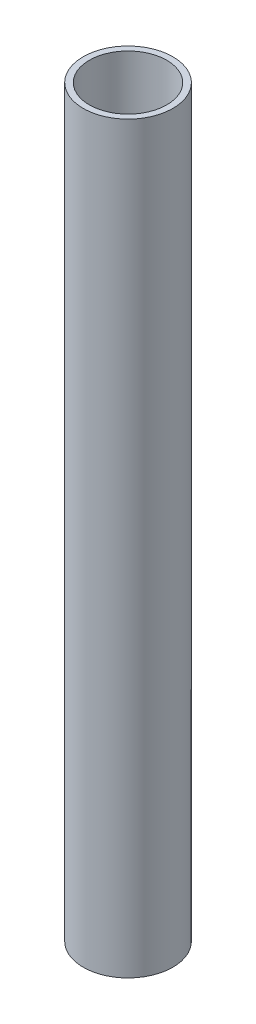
ISO-10303-21;
HEADER;
FILE_DESCRIPTION(('STEP AP214'),'2;1');
FILE_NAME('part.step','',(''),(''),'','','');
FILE_SCHEMA(('AUTOMOTIVE_DESIGN { 1 0 10303 214 1 1 1 1 }'));
ENDSEC;
DATA;
#1=APPLICATION_CONTEXT('core data for automotive mechanical design processes');
#2=APPLICATION_PROTOCOL_DEFINITION('international standard','automotive_design',2000,#1);
#3=PRODUCT_CONTEXT('',#1,'mechanical');
#4=PRODUCT('Part','Part','',(#3));
#5=PRODUCT_RELATED_PRODUCT_CATEGORY('part','',(#4));
#6=PRODUCT_DEFINITION_FORMATION('','',#4);
#7=PRODUCT_DEFINITION_CONTEXT('part definition',#1,'design');
#8=PRODUCT_DEFINITION('design','',#6,#7);
#9=PRODUCT_DEFINITION_SHAPE('','',#8);
#10=(LENGTH_UNIT() NAMED_UNIT(*) SI_UNIT(.MILLI.,.METRE.));
#11=(NAMED_UNIT(*) PLANE_ANGLE_UNIT() SI_UNIT($,.RADIAN.));
#12=(NAMED_UNIT(*) SI_UNIT($,.STERADIAN.) SOLID_ANGLE_UNIT());
#13=UNCERTAINTY_MEASURE_WITH_UNIT(LENGTH_MEASURE(1.E-05),#10,'distance_accuracy_value','');
#14=(GEOMETRIC_REPRESENTATION_CONTEXT(3) GLOBAL_UNCERTAINTY_ASSIGNED_CONTEXT((#13)) GLOBAL_UNIT_ASSIGNED_CONTEXT((#10,
#11,#12)) REPRESENTATION_CONTEXT('',''));
#15=CARTESIAN_POINT('',(0.,0.,0.));
#16=DIRECTION('',(0.,0.,1.));
#17=DIRECTION('',(1.,0.,0.));
#18=AXIS2_PLACEMENT_3D('',#15,#16,#17);
#19=CARTESIAN_POINT('',(0.,122.,0.));
#20=DIRECTION('',(0.,1.,0.));
#21=DIRECTION('',(0.,0.,1.));
#22=AXIS2_PLACEMENT_3D('',#19,#20,#21);
#23=PLANE('',#22);
#24=CARTESIAN_POINT('',(0.,122.,0.));
#25=DIRECTION('',(0.,1.,0.));
#26=DIRECTION('',(0.,0.,1.));
#27=AXIS2_PLACEMENT_3D('',#24,#25,#26);
#28=CIRCLE('',#27,7.35);
#29=CARTESIAN_POINT('',(0.,122.,-7.35));
#30=VERTEX_POINT('',#29);
#31=EDGE_CURVE('E10',#30,#30,#28,.T.);
#32=ORIENTED_EDGE('',*,*,#31,.T.);
#33=EDGE_LOOP('',(#32));
#34=FACE_BOUND('',#33,.T.);
#35=CARTESIAN_POINT('',(0.,122.,0.));
#36=DIRECTION('',(0.,1.,0.));
#37=DIRECTION('',(0.,0.,1.));
#38=AXIS2_PLACEMENT_3D('',#35,#36,#37);
#39=CIRCLE('',#38,6.35);
#40=CARTESIAN_POINT('',(0.,122.,-6.35));
#41=VERTEX_POINT('',#40);
#42=EDGE_CURVE('E56',#41,#41,#39,.T.);
#43=ORIENTED_EDGE('',*,*,#42,.F.);
#44=EDGE_LOOP('',(#43));
#45=FACE_BOUND('',#44,.T.);
#46=ADVANCED_FACE('F43',(#34,#45),#23,.T.);
#47=CARTESIAN_POINT('',(0.,0.,0.));
#48=DIRECTION('',(0.,1.,0.));
#49=DIRECTION('',(0.,0.,1.));
#50=AXIS2_PLACEMENT_3D('',#47,#48,#49);
#51=PLANE('',#50);
#52=CARTESIAN_POINT('',(0.,0.,0.));
#53=DIRECTION('',(0.,1.,0.));
#54=DIRECTION('',(0.,0.,1.));
#55=AXIS2_PLACEMENT_3D('',#52,#53,#54);
#56=CIRCLE('',#55,7.35);
#57=CARTESIAN_POINT('',(0.,0.,-7.35));
#58=VERTEX_POINT('',#57);
#59=EDGE_CURVE('E47',#58,#58,#56,.T.);
#60=ORIENTED_EDGE('',*,*,#59,.F.);
#61=EDGE_LOOP('',(#60));
#62=FACE_BOUND('',#61,.T.);
#63=CARTESIAN_POINT('',(0.,0.,0.));
#64=DIRECTION('',(0.,1.,0.));
#65=DIRECTION('',(0.,0.,1.));
#66=AXIS2_PLACEMENT_3D('',#63,#64,#65);
#67=CIRCLE('',#66,6.35);
#68=CARTESIAN_POINT('',(0.,0.,-6.35));
#69=VERTEX_POINT('',#68);
#70=EDGE_CURVE('E58',#69,#69,#67,.T.);
#71=ORIENTED_EDGE('',*,*,#70,.T.);
#72=EDGE_LOOP('',(#71));
#73=FACE_BOUND('',#72,.T.);
#74=ADVANCED_FACE('F70',(#62,#73),#51,.F.);
#75=CARTESIAN_POINT('',(0.,122.,0.));
#76=DIRECTION('',(0.,-1.,0.));
#77=DIRECTION('',(0.,0.,-1.));
#78=AXIS2_PLACEMENT_3D('',#75,#76,#77);
#79=CYLINDRICAL_SURFACE('',#78,7.35);
#80=CARTESIAN_POINT('',(0.,122.,-7.35));
#81=CARTESIAN_POINT('',(0.,120.729166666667,-7.35));
#82=CARTESIAN_POINT('',(0.,119.458333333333,-7.35));
#83=CARTESIAN_POINT('',(0.,116.916666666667,-7.35));
#84=CARTESIAN_POINT('',(0.,115.645833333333,-7.35));
#85=CARTESIAN_POINT('',(0.,113.104166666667,-7.35));
#86=CARTESIAN_POINT('',(0.,111.833333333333,-7.35));
#87=CARTESIAN_POINT('',(0.,109.291666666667,-7.35));
#88=CARTESIAN_POINT('',(0.,108.020833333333,-7.35));
#89=CARTESIAN_POINT('',(0.,105.479166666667,-7.35));
#90=CARTESIAN_POINT('',(0.,104.208333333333,-7.35));
#91=CARTESIAN_POINT('',(0.,101.666666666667,-7.35));
#92=CARTESIAN_POINT('',(0.,100.395833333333,-7.35));
#93=CARTESIAN_POINT('',(0.,97.8541666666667,-7.35));
#94=CARTESIAN_POINT('',(0.,96.5833333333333,-7.35));
#95=CARTESIAN_POINT('',(0.,94.0416666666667,-7.35));
#96=CARTESIAN_POINT('',(0.,92.7708333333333,-7.35));
#97=CARTESIAN_POINT('',(0.,90.2291666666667,-7.35));
#98=CARTESIAN_POINT('',(0.,88.9583333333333,-7.35));
#99=CARTESIAN_POINT('',(0.,86.4166666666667,-7.35));
#100=CARTESIAN_POINT('',(0.,85.1458333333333,-7.35));
#101=CARTESIAN_POINT('',(0.,82.6041666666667,-7.35));
#102=CARTESIAN_POINT('',(0.,81.3333333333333,-7.35));
#103=CARTESIAN_POINT('',(0.,78.7916666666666,-7.35));
#104=CARTESIAN_POINT('',(0.,77.5208333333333,-7.35));
#105=CARTESIAN_POINT('',(0.,74.9791666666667,-7.35));
#106=CARTESIAN_POINT('',(0.,73.7083333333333,-7.35));
#107=CARTESIAN_POINT('',(0.,71.1666666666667,-7.35));
#108=CARTESIAN_POINT('',(0.,69.8958333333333,-7.35));
#109=CARTESIAN_POINT('',(0.,67.3541666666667,-7.35));
#110=CARTESIAN_POINT('',(0.,66.0833333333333,-7.35));
#111=CARTESIAN_POINT('',(0.,63.5416666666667,-7.35));
#112=CARTESIAN_POINT('',(0.,62.2708333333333,-7.35));
#113=CARTESIAN_POINT('',(0.,59.7291666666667,-7.35));
#114=CARTESIAN_POINT('',(0.,58.4583333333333,-7.35));
#115=CARTESIAN_POINT('',(0.,55.9166666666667,-7.35));
#116=CARTESIAN_POINT('',(0.,54.6458333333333,-7.35));
#117=CARTESIAN_POINT('',(0.,52.1041666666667,-7.35));
#118=CARTESIAN_POINT('',(0.,50.8333333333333,-7.35));
#119=CARTESIAN_POINT('',(0.,48.2916666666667,-7.35));
#120=CARTESIAN_POINT('',(0.,47.0208333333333,-7.35));
#121=CARTESIAN_POINT('',(0.,44.4791666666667,-7.35));
#122=CARTESIAN_POINT('',(0.,43.2083333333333,-7.35));
#123=CARTESIAN_POINT('',(0.,40.6666666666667,-7.35));
#124=CARTESIAN_POINT('',(0.,39.3958333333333,-7.35));
#125=CARTESIAN_POINT('',(0.,36.8541666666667,-7.35));
#126=CARTESIAN_POINT('',(0.,35.5833333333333,-7.35));
#127=CARTESIAN_POINT('',(0.,33.0416666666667,-7.35));
#128=CARTESIAN_POINT('',(0.,31.7708333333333,-7.35));
#129=CARTESIAN_POINT('',(0.,29.2291666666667,-7.35));
#130=CARTESIAN_POINT('',(0.,27.9583333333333,-7.35));
#131=CARTESIAN_POINT('',(0.,25.4166666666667,-7.35));
#132=CARTESIAN_POINT('',(0.,24.1458333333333,-7.35));
#133=CARTESIAN_POINT('',(0.,21.6041666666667,-7.35));
#134=CARTESIAN_POINT('',(0.,20.3333333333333,-7.35));
#135=CARTESIAN_POINT('',(0.,17.7916666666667,-7.35));
#136=CARTESIAN_POINT('',(0.,16.5208333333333,-7.35));
#137=CARTESIAN_POINT('',(0.,13.9791666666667,-7.35));
#138=CARTESIAN_POINT('',(0.,12.7083333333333,-7.35));
#139=CARTESIAN_POINT('',(0.,10.1666666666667,-7.35));
#140=CARTESIAN_POINT('',(0.,8.89583333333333,-7.35));
#141=CARTESIAN_POINT('',(0.,6.35416666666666,-7.35));
#142=CARTESIAN_POINT('',(0.,5.08333333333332,-7.35));
#143=CARTESIAN_POINT('',(0.,2.54166666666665,-7.35));
#144=CARTESIAN_POINT('',(0.,1.27083333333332,-7.35));
#145=CARTESIAN_POINT('',(0.,0.,-7.35));
#146=B_SPLINE_CURVE_WITH_KNOTS('',3,(#80,#81,#82,#83,#84,#85,#86,#87,#88,#89,#90,#91,#92,#93,
#94,#95,#96,#97,#98,#99,#100,#101,#102,#103,#104,#105,#106,#107,#108,#109,#110,#111,#112,#113,
#114,#115,#116,#117,#118,#119,#120,#121,#122,#123,#124,#125,#126,#127,#128,#129,#130,#131,#132,
#133,#134,#135,#136,#137,#138,#139,#140,#141,#142,#143,#144,#145),.UNSPECIFIED.,.F.,.F.,(4,2,2,
2,2,2,2,2,2,2,2,2,2,2,2,2,2,2,2,2,2,2,2,2,2,2,2,2,2,2,2,2,4),(0.,3.81250000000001,
7.62500000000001,11.4375,15.25,19.0625,22.875,26.6875,30.5,34.3125,38.125,41.9375,45.75,49.5625,
53.375,57.1875,61.,64.8125,68.625,72.4375,76.25,80.0625,83.875,87.6875,91.5,95.3125,99.125,
102.9375,106.75,110.5625,114.375,118.1875,122.),.UNSPECIFIED.);
#147=EDGE_CURVE('BSEAM45',#30,#58,#146,.T.);
#148=ORIENTED_EDGE('',*,*,#31,.F.);
#149=ORIENTED_EDGE('',*,*,#59,.T.);
#150=ORIENTED_EDGE('',*,*,#147,.T.);
#151=ORIENTED_EDGE('',*,*,#147,.F.);
#152=EDGE_LOOP('',(#148,#150,#149,#151));
#153=FACE_BOUND('',#152,.T.);
#154=ADVANCED_FACE('F45',(#153),#79,.T.);
#155=CARTESIAN_POINT('',(0.,122.,0.));
#156=DIRECTION('',(0.,-1.,0.));
#157=DIRECTION('',(0.,0.,-1.));
#158=AXIS2_PLACEMENT_3D('',#155,#156,#157);
#159=CYLINDRICAL_SURFACE('',#158,6.35);
#160=CARTESIAN_POINT('',(0.,122.,-6.35));
#161=CARTESIAN_POINT('',(0.,120.729166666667,-6.35));
#162=CARTESIAN_POINT('',(0.,119.458333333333,-6.35));
#163=CARTESIAN_POINT('',(0.,116.916666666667,-6.35));
#164=CARTESIAN_POINT('',(0.,115.645833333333,-6.35));
#165=CARTESIAN_POINT('',(0.,113.104166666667,-6.35));
#166=CARTESIAN_POINT('',(0.,111.833333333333,-6.35));
#167=CARTESIAN_POINT('',(0.,109.291666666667,-6.35));
#168=CARTESIAN_POINT('',(0.,108.020833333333,-6.35));
#169=CARTESIAN_POINT('',(0.,105.479166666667,-6.35));
#170=CARTESIAN_POINT('',(0.,104.208333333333,-6.35));
#171=CARTESIAN_POINT('',(0.,101.666666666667,-6.35));
#172=CARTESIAN_POINT('',(0.,100.395833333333,-6.35));
#173=CARTESIAN_POINT('',(0.,97.8541666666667,-6.35));
#174=CARTESIAN_POINT('',(0.,96.5833333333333,-6.35));
#175=CARTESIAN_POINT('',(0.,94.0416666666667,-6.35));
#176=CARTESIAN_POINT('',(0.,92.7708333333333,-6.35));
#177=CARTESIAN_POINT('',(0.,90.2291666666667,-6.35));
#178=CARTESIAN_POINT('',(0.,88.9583333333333,-6.35));
#179=CARTESIAN_POINT('',(0.,86.4166666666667,-6.35));
#180=CARTESIAN_POINT('',(0.,85.1458333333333,-6.35));
#181=CARTESIAN_POINT('',(0.,82.6041666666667,-6.35));
#182=CARTESIAN_POINT('',(0.,81.3333333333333,-6.35));
#183=CARTESIAN_POINT('',(0.,78.7916666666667,-6.35));
#184=CARTESIAN_POINT('',(0.,77.5208333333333,-6.35));
#185=CARTESIAN_POINT('',(0.,74.9791666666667,-6.35));
#186=CARTESIAN_POINT('',(0.,73.7083333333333,-6.35));
#187=CARTESIAN_POINT('',(0.,71.1666666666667,-6.35));
#188=CARTESIAN_POINT('',(0.,69.8958333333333,-6.35));
#189=CARTESIAN_POINT('',(0.,67.3541666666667,-6.35));
#190=CARTESIAN_POINT('',(0.,66.0833333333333,-6.35));
#191=CARTESIAN_POINT('',(0.,63.5416666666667,-6.35));
#192=CARTESIAN_POINT('',(0.,62.2708333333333,-6.35));
#193=CARTESIAN_POINT('',(0.,59.7291666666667,-6.35));
#194=CARTESIAN_POINT('',(0.,58.4583333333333,-6.35));
#195=CARTESIAN_POINT('',(0.,55.9166666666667,-6.35));
#196=CARTESIAN_POINT('',(0.,54.6458333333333,-6.35));
#197=CARTESIAN_POINT('',(0.,52.1041666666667,-6.35));
#198=CARTESIAN_POINT('',(0.,50.8333333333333,-6.35));
#199=CARTESIAN_POINT('',(0.,48.2916666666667,-6.35));
#200=CARTESIAN_POINT('',(0.,47.0208333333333,-6.35));
#201=CARTESIAN_POINT('',(0.,44.4791666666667,-6.35));
#202=CARTESIAN_POINT('',(0.,43.2083333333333,-6.35));
#203=CARTESIAN_POINT('',(0.,40.6666666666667,-6.35));
#204=CARTESIAN_POINT('',(0.,39.3958333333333,-6.35));
#205=CARTESIAN_POINT('',(0.,36.8541666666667,-6.35));
#206=CARTESIAN_POINT('',(0.,35.5833333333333,-6.35));
#207=CARTESIAN_POINT('',(0.,33.0416666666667,-6.35));
#208=CARTESIAN_POINT('',(0.,31.7708333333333,-6.35));
#209=CARTESIAN_POINT('',(0.,29.2291666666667,-6.35));
#210=CARTESIAN_POINT('',(0.,27.9583333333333,-6.35));
#211=CARTESIAN_POINT('',(0.,25.4166666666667,-6.35));
#212=CARTESIAN_POINT('',(0.,24.1458333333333,-6.35));
#213=CARTESIAN_POINT('',(0.,21.6041666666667,-6.35));
#214=CARTESIAN_POINT('',(0.,20.3333333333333,-6.35));
#215=CARTESIAN_POINT('',(0.,17.7916666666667,-6.35));
#216=CARTESIAN_POINT('',(0.,16.5208333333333,-6.35));
#217=CARTESIAN_POINT('',(0.,13.9791666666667,-6.35));
#218=CARTESIAN_POINT('',(0.,12.7083333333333,-6.35));
#219=CARTESIAN_POINT('',(0.,10.1666666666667,-6.35));
#220=CARTESIAN_POINT('',(0.,8.89583333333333,-6.35));
#221=CARTESIAN_POINT('',(0.,6.35416666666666,-6.35));
#222=CARTESIAN_POINT('',(0.,5.08333333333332,-6.35));
#223=CARTESIAN_POINT('',(0.,2.54166666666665,-6.35));
#224=CARTESIAN_POINT('',(0.,1.27083333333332,-6.35));
#225=CARTESIAN_POINT('',(0.,0.,-6.35));
#226=B_SPLINE_CURVE_WITH_KNOTS('',3,(#160,#161,#162,#163,#164,#165,#166,#167,#168,#169,#170,
#171,#172,#173,#174,#175,#176,#177,#178,#179,#180,#181,#182,#183,#184,#185,#186,#187,#188,#189,
#190,#191,#192,#193,#194,#195,#196,#197,#198,#199,#200,#201,#202,#203,#204,#205,#206,#207,#208,
#209,#210,#211,#212,#213,#214,#215,#216,#217,#218,#219,#220,#221,#222,#223,#224,#225),
.UNSPECIFIED.,.F.,.F.,(4,2,2,2,2,2,2,2,2,2,2,2,2,2,2,2,2,2,2,2,2,2,2,2,2,2,2,2,2,2,2,2,4),(0.,
3.8125,7.62499999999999,11.4375,15.25,19.0625,22.875,26.6875,30.5,34.3125,38.125,41.9375,45.75,
49.5625,53.375,57.1875,61.,64.8125,68.625,72.4375,76.25,80.0625,83.875,87.6875,91.5,95.3125,
99.125,102.9375,106.75,110.5625,114.375,118.1875,122.),.UNSPECIFIED.);
#227=EDGE_CURVE('BSEAM66',#41,#69,#226,.T.);
#228=ORIENTED_EDGE('',*,*,#42,.T.);
#229=ORIENTED_EDGE('',*,*,#70,.F.);
#230=ORIENTED_EDGE('',*,*,#227,.T.);
#231=ORIENTED_EDGE('',*,*,#227,.F.);
#232=EDGE_LOOP('',(#228,#230,#229,#231));
#233=FACE_BOUND('',#232,.T.);
#234=ADVANCED_FACE('F66',(#233),#159,.F.);
#235=CLOSED_SHELL('',(#46,#74,#154,#234));
#236=MANIFOLD_SOLID_BREP('B2',#235);
#237=ADVANCED_BREP_SHAPE_REPRESENTATION('',(#18,#236),#14);
#238=SHAPE_DEFINITION_REPRESENTATION(#9,#237);
ENDSEC;
END-ISO-10303-21;
